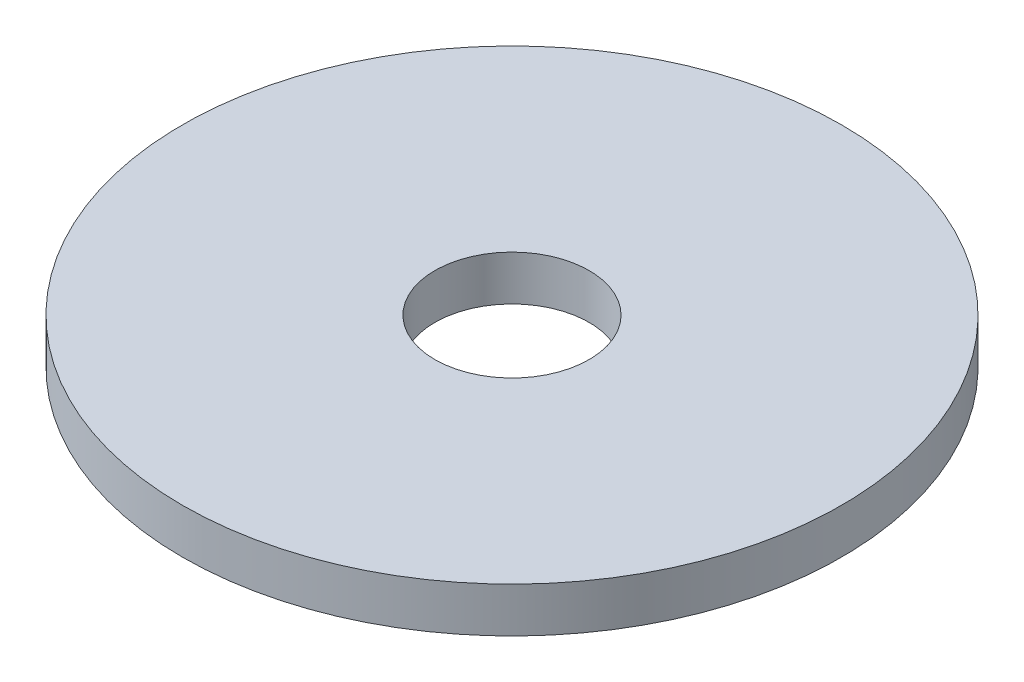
ISO-10303-21;
HEADER;
FILE_DESCRIPTION(('STEP AP214'),'2;1');
FILE_NAME('part.step','',(''),(''),'','','');
FILE_SCHEMA(('AUTOMOTIVE_DESIGN { 1 0 10303 214 1 1 1 1 }'));
ENDSEC;
DATA;
#1=APPLICATION_CONTEXT('core data for automotive mechanical design processes');
#2=APPLICATION_PROTOCOL_DEFINITION('international standard','automotive_design',2000,#1);
#3=PRODUCT_CONTEXT('',#1,'mechanical');
#4=PRODUCT('Part','Part','',(#3));
#5=PRODUCT_RELATED_PRODUCT_CATEGORY('part','',(#4));
#6=PRODUCT_DEFINITION_FORMATION('','',#4);
#7=PRODUCT_DEFINITION_CONTEXT('part definition',#1,'design');
#8=PRODUCT_DEFINITION('design','',#6,#7);
#9=PRODUCT_DEFINITION_SHAPE('','',#8);
#10=(LENGTH_UNIT() NAMED_UNIT(*) SI_UNIT(.MILLI.,.METRE.));
#11=(NAMED_UNIT(*) PLANE_ANGLE_UNIT() SI_UNIT($,.RADIAN.));
#12=(NAMED_UNIT(*) SI_UNIT($,.STERADIAN.) SOLID_ANGLE_UNIT());
#13=UNCERTAINTY_MEASURE_WITH_UNIT(LENGTH_MEASURE(1.E-05),#10,'distance_accuracy_value','');
#14=(GEOMETRIC_REPRESENTATION_CONTEXT(3) GLOBAL_UNCERTAINTY_ASSIGNED_CONTEXT((#13)) GLOBAL_UNIT_ASSIGNED_CONTEXT((#10,
#11,#12)) REPRESENTATION_CONTEXT('',''));
#15=CARTESIAN_POINT('',(0.,0.,0.));
#16=DIRECTION('',(0.,0.,1.));
#17=DIRECTION('',(1.,0.,0.));
#18=AXIS2_PLACEMENT_3D('',#15,#16,#17);
#19=CARTESIAN_POINT('',(0.,0.,0.));
#20=DIRECTION('',(0.,1.,0.));
#21=DIRECTION('',(0.,0.,1.));
#22=AXIS2_PLACEMENT_3D('',#19,#20,#21);
#23=CYLINDRICAL_SURFACE('',#22,5.15);
#24=CARTESIAN_POINT('',(0.,3.,0.));
#25=DIRECTION('',(0.,1.,0.));
#26=DIRECTION('',(0.,0.,1.));
#27=AXIS2_PLACEMENT_3D('',#24,#25,#26);
#28=CIRCLE('',#27,5.15);
#29=CARTESIAN_POINT('',(0.,3.,5.15));
#30=VERTEX_POINT('',#29);
#31=EDGE_CURVE('E10',#30,#30,#28,.T.);
#32=ORIENTED_EDGE('',*,*,#31,.T.);
#33=EDGE_LOOP('',(#32));
#34=FACE_BOUND('',#33,.T.);
#35=CARTESIAN_POINT('',(0.,0.,0.));
#36=DIRECTION('',(0.,1.,0.));
#37=DIRECTION('',(0.,0.,1.));
#38=AXIS2_PLACEMENT_3D('',#35,#36,#37);
#39=CIRCLE('',#38,5.15);
#40=CARTESIAN_POINT('',(0.,0.,5.15));
#41=VERTEX_POINT('',#40);
#42=EDGE_CURVE('E46',#41,#41,#39,.T.);
#43=ORIENTED_EDGE('',*,*,#42,.F.);
#44=EDGE_LOOP('',(#43));
#45=FACE_BOUND('',#44,.T.);
#46=ADVANCED_FACE('F32',(#34,#45),#23,.F.);
#47=CARTESIAN_POINT('',(5.15,3.,0.));
#48=DIRECTION('',(0.,1.,0.));
#49=DIRECTION('',(0.,0.,1.));
#50=AXIS2_PLACEMENT_3D('',#47,#48,#49);
#51=PLANE('',#50);
#52=CARTESIAN_POINT('',(0.,3.,0.));
#53=DIRECTION('',(0.,1.,0.));
#54=DIRECTION('',(0.,0.,1.));
#55=AXIS2_PLACEMENT_3D('',#52,#53,#54);
#56=CIRCLE('',#55,22.);
#57=CARTESIAN_POINT('',(0.,3.,22.));
#58=VERTEX_POINT('',#57);
#59=EDGE_CURVE('E38',#58,#58,#56,.T.);
#60=ORIENTED_EDGE('',*,*,#59,.T.);
#61=EDGE_LOOP('',(#60));
#62=FACE_BOUND('',#61,.T.);
#63=ORIENTED_EDGE('',*,*,#31,.F.);
#64=EDGE_LOOP('',(#63));
#65=FACE_BOUND('',#64,.T.);
#66=ADVANCED_FACE('F56',(#62,#65),#51,.T.);
#67=CARTESIAN_POINT('',(0.,0.,0.));
#68=DIRECTION('',(0.,1.,0.));
#69=DIRECTION('',(0.,0.,1.));
#70=AXIS2_PLACEMENT_3D('',#67,#68,#69);
#71=CYLINDRICAL_SURFACE('',#70,22.);
#72=CARTESIAN_POINT('',(0.,0.,0.));
#73=DIRECTION('',(0.,1.,0.));
#74=DIRECTION('',(0.,0.,1.));
#75=AXIS2_PLACEMENT_3D('',#72,#73,#74);
#76=CIRCLE('',#75,22.);
#77=CARTESIAN_POINT('',(0.,0.,22.));
#78=VERTEX_POINT('',#77);
#79=EDGE_CURVE('E42',#78,#78,#76,.T.);
#80=ORIENTED_EDGE('',*,*,#79,.T.);
#81=EDGE_LOOP('',(#80));
#82=FACE_BOUND('',#81,.T.);
#83=ORIENTED_EDGE('',*,*,#59,.F.);
#84=EDGE_LOOP('',(#83));
#85=FACE_BOUND('',#84,.T.);
#86=ADVANCED_FACE('F60',(#82,#85),#71,.T.);
#87=CARTESIAN_POINT('',(22.,0.,0.));
#88=DIRECTION('',(0.,-1.,0.));
#89=DIRECTION('',(0.,0.,-1.));
#90=AXIS2_PLACEMENT_3D('',#87,#88,#89);
#91=PLANE('',#90);
#92=ORIENTED_EDGE('',*,*,#42,.T.);
#93=EDGE_LOOP('',(#92));
#94=FACE_BOUND('',#93,.T.);
#95=ORIENTED_EDGE('',*,*,#79,.F.);
#96=EDGE_LOOP('',(#95));
#97=FACE_BOUND('',#96,.T.);
#98=ADVANCED_FACE('F52',(#94,#97),#91,.T.);
#99=CLOSED_SHELL('',(#46,#66,#86,#98));
#100=MANIFOLD_SOLID_BREP('B2',#99);
#101=ADVANCED_BREP_SHAPE_REPRESENTATION('',(#18,#100),#14);
#102=SHAPE_DEFINITION_REPRESENTATION(#9,#101);
ENDSEC;
END-ISO-10303-21;
